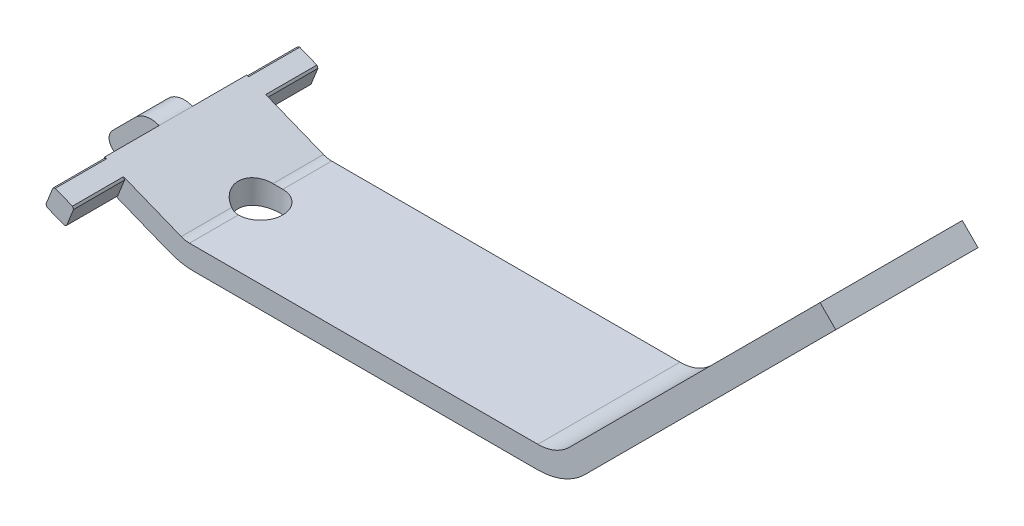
ISO-10303-21;
HEADER;
FILE_DESCRIPTION(('STEP AP214'),'2;1');
FILE_NAME('part.step','',(''),(''),'','','');
FILE_SCHEMA(('AUTOMOTIVE_DESIGN { 1 0 10303 214 1 1 1 1 }'));
ENDSEC;
DATA;
#1=APPLICATION_CONTEXT('core data for automotive mechanical design processes');
#2=APPLICATION_PROTOCOL_DEFINITION('international standard','automotive_design',2000,#1);
#3=PRODUCT_CONTEXT('',#1,'mechanical');
#4=PRODUCT('Part','Part','',(#3));
#5=PRODUCT_RELATED_PRODUCT_CATEGORY('part','',(#4));
#6=PRODUCT_DEFINITION_FORMATION('','',#4);
#7=PRODUCT_DEFINITION_CONTEXT('part definition',#1,'design');
#8=PRODUCT_DEFINITION('design','',#6,#7);
#9=PRODUCT_DEFINITION_SHAPE('','',#8);
#10=(LENGTH_UNIT() NAMED_UNIT(*) SI_UNIT(.MILLI.,.METRE.));
#11=(NAMED_UNIT(*) PLANE_ANGLE_UNIT() SI_UNIT($,.RADIAN.));
#12=(NAMED_UNIT(*) SI_UNIT($,.STERADIAN.) SOLID_ANGLE_UNIT());
#13=UNCERTAINTY_MEASURE_WITH_UNIT(LENGTH_MEASURE(1.E-05),#10,'distance_accuracy_value','');
#14=(GEOMETRIC_REPRESENTATION_CONTEXT(3) GLOBAL_UNCERTAINTY_ASSIGNED_CONTEXT((#13)) GLOBAL_UNIT_ASSIGNED_CONTEXT((#10,
#11,#12)) REPRESENTATION_CONTEXT('',''));
#15=CARTESIAN_POINT('',(0.,0.,0.));
#16=DIRECTION('',(0.,0.,1.));
#17=DIRECTION('',(1.,0.,0.));
#18=AXIS2_PLACEMENT_3D('',#15,#16,#17);
#19=CARTESIAN_POINT('',(3.73112428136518,1.2,3.2));
#20=DIRECTION('',(0.,0.,-1.));
#21=DIRECTION('',(-1.,0.,0.));
#22=AXIS2_PLACEMENT_3D('',#19,#20,#21);
#23=CYLINDRICAL_SURFACE('',#22,3.);
#24=CARTESIAN_POINT('',(2.61683856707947,-1.58538459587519,-0.387945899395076));
#25=CARTESIAN_POINT('',(2.639047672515,-1.59426285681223,-0.440770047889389));
#26=CARTESIAN_POINT('',(2.66571598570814,-1.60463297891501,-0.491380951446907));
#27=CARTESIAN_POINT('',(2.72699278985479,-1.62715226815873,-0.587054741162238));
#28=CARTESIAN_POINT('',(2.76159483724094,-1.63929998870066,-0.632122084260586));
#29=CARTESIAN_POINT('',(2.83776356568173,-1.66417616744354,-0.715636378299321));
#30=CARTESIAN_POINT('',(2.87932357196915,-1.67690406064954,-0.754089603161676));
#31=CARTESIAN_POINT('',(2.96843372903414,-1.70179977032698,-0.823522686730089));
#32=CARTESIAN_POINT('',(3.01598406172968,-1.7139675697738,-0.854502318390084));
#33=CARTESIAN_POINT('',(3.1167874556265,-1.73688632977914,-0.908550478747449));
#34=CARTESIAN_POINT('',(3.17012227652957,-1.74761033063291,-0.931478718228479));
#35=CARTESIAN_POINT('',(3.28035079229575,-1.76646697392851,-0.967840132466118));
#36=CARTESIAN_POINT('',(3.33724266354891,-1.7746009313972,-0.981278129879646));
#37=CARTESIAN_POINT('',(3.45048145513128,-1.78736378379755,-0.997686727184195));
#38=CARTESIAN_POINT('',(3.50675199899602,-1.79212481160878,-1.00107083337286));
#39=CARTESIAN_POINT('',(3.59114023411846,-1.79686651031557,-0.999014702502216));
#40=CARTESIAN_POINT('',(3.6193198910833,-1.79804704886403,-0.997130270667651));
#41=CARTESIAN_POINT('',(3.67544696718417,-1.79961498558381,-0.990983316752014));
#42=CARTESIAN_POINT('',(3.7033943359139,-1.80000221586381,-0.986720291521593));
#43=CARTESIAN_POINT('',(3.73112428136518,-1.8,-0.981276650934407));
#44=B_SPLINE_CURVE_WITH_KNOTS('',3,(#24,#25,#26,#27,#28,#29,#30,#31,#32,#33,#34,#35,#36,#37,#38,
#39,#40,#41,#42,#43),.UNSPECIFIED.,.F.,.F.,(4,2,2,2,2,2,2,2,2,4),(0.,0.173622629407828,
0.347104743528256,0.520421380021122,0.693743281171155,0.869950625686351,1.0460683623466,
1.2148347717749,1.29953835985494,1.38425987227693),.UNSPECIFIED.);
#45=CARTESIAN_POINT('',(2.61683856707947,-1.58538459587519,-0.387945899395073));
#46=VERTEX_POINT('',#45);
#47=CARTESIAN_POINT('',(3.73112428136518,-1.8,-0.981276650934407));
#48=VERTEX_POINT('',#47);
#49=EDGE_CURVE('E270',#46,#48,#44,.T.);
#50=ORIENTED_EDGE('',*,*,#49,.F.);
#51=DIRECTION('',(0.,0.,-1.));
#52=VECTOR('',#51,1.);
#53=CARTESIAN_POINT('',(2.61683856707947,-1.58538459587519,3.2));
#54=LINE('',#53,#52);
#55=CARTESIAN_POINT('',(2.61683856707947,-1.58538459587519,-3.2));
#56=VERTEX_POINT('',#55);
#57=EDGE_CURVE('E301',#56,#46,#54,.F.);
#58=ORIENTED_EDGE('',*,*,#57,.F.);
#59=CARTESIAN_POINT('',(3.73112428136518,1.2,-3.2));
#60=DIRECTION('',(0.,0.,1.));
#61=DIRECTION('',(1.,0.,0.));
#62=AXIS2_PLACEMENT_3D('',#59,#60,#61);
#63=CIRCLE('',#62,3.);
#64=CARTESIAN_POINT('',(3.73112428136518,-1.8,-3.2));
#65=VERTEX_POINT('',#64);
#66=EDGE_CURVE('E289',#65,#56,#63,.F.);
#67=ORIENTED_EDGE('',*,*,#66,.F.);
#68=DIRECTION('',(0.,0.,-1.));
#69=VECTOR('',#68,1.);
#70=CARTESIAN_POINT('',(3.73112428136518,-1.8,3.2));
#71=LINE('',#70,#69);
#72=EDGE_CURVE('E283',#48,#65,#71,.T.);
#73=ORIENTED_EDGE('',*,*,#72,.F.);
#74=EDGE_LOOP('',(#50,#58,#67,#73));
#75=FACE_BOUND('',#74,.T.);
#76=ADVANCED_FACE('F33',(#75),#23,.T.);
#77=CARTESIAN_POINT('',(3.53852071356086,0.2,3.2));
#78=DIRECTION('',(0.,0.,1.));
#79=DIRECTION('',(1.,0.,0.));
#80=AXIS2_PLACEMENT_3D('',#77,#78,#79);
#81=CYLINDRICAL_SURFACE('',#80,1.);
#82=DIRECTION('',(0.,0.,-1.));
#83=VECTOR('',#82,1.);
#84=CARTESIAN_POINT('',(3.53852071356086,-0.8,3.2));
#85=LINE('',#84,#83);
#86=CARTESIAN_POINT('',(3.53852071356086,-0.8,1.));
#87=VERTEX_POINT('',#86);
#88=CARTESIAN_POINT('',(3.53852071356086,-0.8,3.2));
#89=VERTEX_POINT('',#88);
#90=EDGE_CURVE('E309',#87,#89,#85,.F.);
#91=ORIENTED_EDGE('',*,*,#90,.F.);
#92=CARTESIAN_POINT('',(3.53852071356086,0.2,0.));
#93=DIRECTION('',(0.,0.707106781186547,0.707106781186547));
#94=DIRECTION('',(0.,-0.707106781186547,0.707106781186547));
#95=AXIS2_PLACEMENT_3D('',#92,#93,#94);
#96=ELLIPSE('',#95,1.41421356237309,1.);
#97=CARTESIAN_POINT('',(3.16709214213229,-0.728461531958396,0.928461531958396));
#98=VERTEX_POINT('',#97);
#99=EDGE_CURVE('E12',#87,#98,#96,.F.);
#100=ORIENTED_EDGE('',*,*,#99,.T.);
#101=DIRECTION('',(0.,0.,-1.));
#102=VECTOR('',#101,1.);
#103=CARTESIAN_POINT('',(3.16709214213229,-0.728461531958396,-3.2));
#104=LINE('',#103,#102);
#105=CARTESIAN_POINT('',(3.16709214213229,-0.728461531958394,3.2));
#106=VERTEX_POINT('',#105);
#107=EDGE_CURVE('E306',#106,#98,#104,.T.);
#108=ORIENTED_EDGE('',*,*,#107,.F.);
#109=CARTESIAN_POINT('',(3.53852071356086,0.2,3.2));
#110=DIRECTION('',(0.,0.,1.));
#111=DIRECTION('',(1.,0.,0.));
#112=AXIS2_PLACEMENT_3D('',#109,#110,#111);
#113=CIRCLE('',#112,1.);
#114=EDGE_CURVE('E315',#89,#106,#113,.F.);
#115=ORIENTED_EDGE('',*,*,#114,.F.);
#116=EDGE_LOOP('',(#91,#100,#108,#115));
#117=FACE_BOUND('',#116,.T.);
#118=ADVANCED_FACE('F598',(#117),#81,.F.);
#119=CARTESIAN_POINT('',(-0.278516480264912,0.649945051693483,3.2));
#120=DIRECTION('',(0.928461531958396,-0.371428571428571,0.));
#121=DIRECTION('',(0.371428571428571,0.928461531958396,0.));
#122=AXIS2_PLACEMENT_3D('',#119,#120,#121);
#123=PLANE('',#122);
#124=DIRECTION('',(0.371428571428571,0.928461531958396,0.));
#125=VECTOR('',#124,1.);
#126=CARTESIAN_POINT('',(-0.278516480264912,0.649945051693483,0.75));
#127=LINE('',#126,#125);
#128=CARTESIAN_POINT('',(-0.649945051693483,-0.278516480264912,0.75));
#129=VERTEX_POINT('',#128);
#130=CARTESIAN_POINT('',(-0.278516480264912,0.649945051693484,0.75));
#131=VERTEX_POINT('',#130);
#132=EDGE_CURVE('E391',#129,#131,#127,.T.);
#133=ORIENTED_EDGE('',*,*,#132,.F.);
#134=DIRECTION('',(0.,0.,-1.));
#135=VECTOR('',#134,1.);
#136=CARTESIAN_POINT('',(-0.649945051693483,-0.278516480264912,3.2));
#137=LINE('',#136,#135);
#138=CARTESIAN_POINT('',(-0.649945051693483,-0.278516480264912,3.2));
#139=VERTEX_POINT('',#138);
#140=EDGE_CURVE('E354',#139,#129,#137,.T.);
#141=ORIENTED_EDGE('',*,*,#140,.F.);
#142=DIRECTION('',(-0.371428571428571,-0.928461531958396,0.));
#143=VECTOR('',#142,1.);
#144=CARTESIAN_POINT('',(-0.278516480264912,0.649945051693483,3.2));
#145=LINE('',#144,#143);
#146=CARTESIAN_POINT('',(-0.618496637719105,-0.199904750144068,3.2));
#147=VERTEX_POINT('',#146);
#148=EDGE_CURVE('E507',#147,#139,#145,.T.);
#149=ORIENTED_EDGE('',*,*,#148,.F.);
#150=DIRECTION('',(0.,0.,1.));
#151=VECTOR('',#150,1.);
#152=CARTESIAN_POINT('',(-0.618496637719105,-0.199904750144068,-32.8346058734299));
#153=LINE('',#152,#151);
#154=CARTESIAN_POINT('',(-0.618496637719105,-0.199904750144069,5.5));
#155=VERTEX_POINT('',#154);
#156=EDGE_CURVE('E493',#155,#147,#153,.F.);
#157=ORIENTED_EDGE('',*,*,#156,.F.);
#158=DIRECTION('',(-0.371428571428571,-0.928461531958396,0.));
#159=VECTOR('',#158,1.);
#160=CARTESIAN_POINT('',(-0.278516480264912,0.649945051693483,5.5));
#161=LINE('',#160,#159);
#162=CARTESIAN_POINT('',(-0.309964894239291,0.57133332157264,5.5));
#163=VERTEX_POINT('',#162);
#164=EDGE_CURVE('E512',#163,#155,#161,.T.);
#165=ORIENTED_EDGE('',*,*,#164,.F.);
#166=DIRECTION('',(0.,0.,1.));
#167=VECTOR('',#166,1.);
#168=CARTESIAN_POINT('',(-0.309964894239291,0.57133332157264,-32.8346058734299));
#169=LINE('',#168,#167);
#170=CARTESIAN_POINT('',(-0.309964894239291,0.57133332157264,3.2));
#171=VERTEX_POINT('',#170);
#172=EDGE_CURVE('E495',#171,#163,#169,.T.);
#173=ORIENTED_EDGE('',*,*,#172,.F.);
#174=CARTESIAN_POINT('',(-0.278516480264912,0.649945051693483,3.2));
#175=VERTEX_POINT('',#174);
#176=EDGE_CURVE('E505',#175,#171,#145,.T.);
#177=ORIENTED_EDGE('',*,*,#176,.F.);
#178=DIRECTION('',(0.,0.,-1.));
#179=VECTOR('',#178,1.);
#180=CARTESIAN_POINT('',(-0.278516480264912,0.649945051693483,3.2));
#181=LINE('',#180,#179);
#182=EDGE_CURVE('E381',#175,#131,#181,.T.);
#183=ORIENTED_EDGE('',*,*,#182,.T.);
#184=EDGE_LOOP('',(#133,#141,#149,#157,#165,#173,#177,#183));
#185=FACE_BOUND('',#184,.T.);
#186=ADVANCED_FACE('F603',(#185),#123,.F.);
#187=CARTESIAN_POINT('',(0.185714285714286,0.464230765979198,3.2));
#188=DIRECTION('',(-0.371428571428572,-0.928461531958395,0.));
#189=DIRECTION('',(0.928461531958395,-0.371428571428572,0.));
#190=AXIS2_PLACEMENT_3D('',#187,#188,#189);
#191=PLANE('',#190);
#192=ORIENTED_EDGE('',*,*,#107,.T.);
#193=CARTESIAN_POINT('',(3.53852071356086,-0.877050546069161,0.));
#194=DIRECTION('',(-0.371428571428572,-0.928461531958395,0.));
#195=DIRECTION('',(-0.928461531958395,0.371428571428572,0.));
#196=AXIS2_PLACEMENT_3D('',#193,#194,#195);
#197=ELLIPSE('',#196,1.07705054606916,1.);
#198=CARTESIAN_POINT('',(3.16709214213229,-0.728461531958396,-0.928461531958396));
#199=VERTEX_POINT('',#198);
#200=EDGE_CURVE('E619',#98,#199,#197,.T.);
#201=ORIENTED_EDGE('',*,*,#200,.T.);
#202=CARTESIAN_POINT('',(3.16709214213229,-0.728461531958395,-3.2));
#203=VERTEX_POINT('',#202);
#204=EDGE_CURVE('E305',#199,#203,#104,.T.);
#205=ORIENTED_EDGE('',*,*,#204,.T.);
#206=DIRECTION('',(-0.928461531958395,0.371428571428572,0.));
#207=VECTOR('',#206,1.);
#208=CARTESIAN_POINT('',(0.185714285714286,0.464230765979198,-3.2));
#209=LINE('',#208,#207);
#210=CARTESIAN_POINT('',(0.57133332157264,0.309964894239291,-3.2));
#211=VERTEX_POINT('',#210);
#212=EDGE_CURVE('E333',#203,#211,#209,.T.);
#213=ORIENTED_EDGE('',*,*,#212,.T.);
#214=DIRECTION('',(0.,0.,-1.));
#215=VECTOR('',#214,1.);
#216=CARTESIAN_POINT('',(0.57133332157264,0.309964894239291,32.8346058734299));
#217=LINE('',#216,#215);
#218=CARTESIAN_POINT('',(0.57133332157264,0.309964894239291,-5.5));
#219=VERTEX_POINT('',#218);
#220=EDGE_CURVE('E471',#219,#211,#217,.F.);
#221=ORIENTED_EDGE('',*,*,#220,.F.);
#222=DIRECTION('',(-0.928461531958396,0.371428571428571,0.));
#223=VECTOR('',#222,1.);
#224=CARTESIAN_POINT('',(-0.278516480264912,0.649945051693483,-5.5));
#225=LINE('',#224,#223);
#226=CARTESIAN_POINT('',(-0.199904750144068,0.618496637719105,-5.5));
#227=VERTEX_POINT('',#226);
#228=EDGE_CURVE('E504',#219,#227,#225,.T.);
#229=ORIENTED_EDGE('',*,*,#228,.T.);
#230=DIRECTION('',(0.,0.,-1.));
#231=VECTOR('',#230,1.);
#232=CARTESIAN_POINT('',(-0.199904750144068,0.618496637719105,32.8346058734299));
#233=LINE('',#232,#231);
#234=CARTESIAN_POINT('',(-0.199904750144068,0.618496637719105,-3.2));
#235=VERTEX_POINT('',#234);
#236=EDGE_CURVE('E474',#235,#227,#233,.T.);
#237=ORIENTED_EDGE('',*,*,#236,.F.);
#238=DIRECTION('',(-0.928461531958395,0.371428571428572,0.));
#239=VECTOR('',#238,1.);
#240=CARTESIAN_POINT('',(0.185714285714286,0.464230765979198,-3.2));
#241=LINE('',#240,#239);
#242=CARTESIAN_POINT('',(-0.278516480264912,0.649945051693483,-3.2));
#243=VERTEX_POINT('',#242);
#244=EDGE_CURVE('E454',#235,#243,#241,.T.);
#245=ORIENTED_EDGE('',*,*,#244,.T.);
#246=CARTESIAN_POINT('',(-0.278516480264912,0.649945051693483,-0.75));
#247=VERTEX_POINT('',#246);
#248=EDGE_CURVE('E356',#247,#243,#181,.T.);
#249=ORIENTED_EDGE('',*,*,#248,.F.);
#250=DIRECTION('',(0.,0.,-1.));
#251=VECTOR('',#250,1.);
#252=CARTESIAN_POINT('',(-0.278516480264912,0.649945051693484,0.75));
#253=LINE('',#252,#251);
#254=EDGE_CURVE('E398',#131,#247,#253,.T.);
#255=ORIENTED_EDGE('',*,*,#254,.F.);
#256=ORIENTED_EDGE('',*,*,#182,.F.);
#257=DIRECTION('',(-0.928461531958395,0.371428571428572,0.));
#258=VECTOR('',#257,1.);
#259=CARTESIAN_POINT('',(0.185714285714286,0.464230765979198,3.2));
#260=LINE('',#259,#258);
#261=CARTESIAN_POINT('',(-0.199904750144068,0.618496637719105,3.2));
#262=VERTEX_POINT('',#261);
#263=EDGE_CURVE('E502',#262,#175,#260,.T.);
#264=ORIENTED_EDGE('',*,*,#263,.F.);
#265=DIRECTION('',(0.,0.,1.));
#266=VECTOR('',#265,1.);
#267=CARTESIAN_POINT('',(-0.199904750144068,0.618496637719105,-32.8346058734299));
#268=LINE('',#267,#266);
#269=CARTESIAN_POINT('',(-0.199904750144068,0.618496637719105,5.5));
#270=VERTEX_POINT('',#269);
#271=EDGE_CURVE('E497',#270,#262,#268,.F.);
#272=ORIENTED_EDGE('',*,*,#271,.F.);
#273=DIRECTION('',(-0.928461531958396,0.371428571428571,0.));
#274=VECTOR('',#273,1.);
#275=CARTESIAN_POINT('',(-0.278516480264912,0.649945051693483,5.5));
#276=LINE('',#275,#274);
#277=CARTESIAN_POINT('',(0.57133332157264,0.309964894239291,5.5));
#278=VERTEX_POINT('',#277);
#279=EDGE_CURVE('E509',#278,#270,#276,.T.);
#280=ORIENTED_EDGE('',*,*,#279,.F.);
#281=DIRECTION('',(0.,0.,1.));
#282=VECTOR('',#281,1.);
#283=CARTESIAN_POINT('',(0.57133332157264,0.309964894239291,-32.8346058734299));
#284=LINE('',#283,#282);
#285=CARTESIAN_POINT('',(0.57133332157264,0.309964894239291,3.2));
#286=VERTEX_POINT('',#285);
#287=EDGE_CURVE('E499',#286,#278,#284,.T.);
#288=ORIENTED_EDGE('',*,*,#287,.F.);
#289=DIRECTION('',(-0.928461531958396,0.371428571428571,0.));
#290=VECTOR('',#289,1.);
#291=CARTESIAN_POINT('',(0.185714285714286,0.464230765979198,3.2));
#292=LINE('',#291,#290);
#293=EDGE_CURVE('E550',#106,#286,#292,.T.);
#294=ORIENTED_EDGE('',*,*,#293,.F.);
#295=EDGE_LOOP('',(#192,#201,#205,#213,#221,#229,#237,#245,#249,#255,#256,#264,#272,#280,#288,#294));
#296=FACE_BOUND('',#295,.T.);
#297=ADVANCED_FACE('F718',(#296),#191,.F.);
#298=CARTESIAN_POINT('',(-0.649945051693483,-0.278516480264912,-0.75));
#299=VERTEX_POINT('',#298);
#300=CARTESIAN_POINT('',(-0.649945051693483,-0.278516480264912,-3.2));
#301=VERTEX_POINT('',#300);
#302=EDGE_CURVE('E351',#299,#301,#137,.T.);
#303=ORIENTED_EDGE('',*,*,#302,.F.);
#304=DIRECTION('',(0.371428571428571,0.928461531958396,0.));
#305=VECTOR('',#304,1.);
#306=CARTESIAN_POINT('',(-0.278516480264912,0.649945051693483,-0.75));
#307=LINE('',#306,#305);
#308=EDGE_CURVE('E278',#299,#247,#307,.T.);
#309=ORIENTED_EDGE('',*,*,#308,.T.);
#310=ORIENTED_EDGE('',*,*,#248,.T.);
#311=DIRECTION('',(-0.371428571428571,-0.928461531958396,0.));
#312=VECTOR('',#311,1.);
#313=CARTESIAN_POINT('',(-0.278516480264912,0.649945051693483,-3.2));
#314=LINE('',#313,#312);
#315=CARTESIAN_POINT('',(-0.309964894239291,0.57133332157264,-3.2));
#316=VERTEX_POINT('',#315);
#317=EDGE_CURVE('E458',#243,#316,#314,.T.);
#318=ORIENTED_EDGE('',*,*,#317,.T.);
#319=DIRECTION('',(0.,0.,-1.));
#320=VECTOR('',#319,1.);
#321=CARTESIAN_POINT('',(-0.309964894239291,0.57133332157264,32.8346058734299));
#322=LINE('',#321,#320);
#323=CARTESIAN_POINT('',(-0.309964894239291,0.57133332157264,-5.5));
#324=VERTEX_POINT('',#323);
#325=EDGE_CURVE('E467',#324,#316,#322,.F.);
#326=ORIENTED_EDGE('',*,*,#325,.F.);
#327=DIRECTION('',(-0.371428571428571,-0.928461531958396,0.));
#328=VECTOR('',#327,1.);
#329=CARTESIAN_POINT('',(-0.278516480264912,0.649945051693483,-5.5));
#330=LINE('',#329,#328);
#331=CARTESIAN_POINT('',(-0.618496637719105,-0.199904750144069,-5.5));
#332=VERTEX_POINT('',#331);
#333=EDGE_CURVE('E525',#324,#332,#330,.T.);
#334=ORIENTED_EDGE('',*,*,#333,.T.);
#335=DIRECTION('',(0.,0.,-1.));
#336=VECTOR('',#335,1.);
#337=CARTESIAN_POINT('',(-0.618496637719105,-0.199904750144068,32.8346058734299));
#338=LINE('',#337,#336);
#339=CARTESIAN_POINT('',(-0.618496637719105,-0.199904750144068,-3.2));
#340=VERTEX_POINT('',#339);
#341=EDGE_CURVE('E469',#340,#332,#338,.T.);
#342=ORIENTED_EDGE('',*,*,#341,.F.);
#343=EDGE_CURVE('E461',#340,#301,#314,.T.);
#344=ORIENTED_EDGE('',*,*,#343,.T.);
#345=EDGE_LOOP('',(#303,#309,#310,#318,#326,#334,#342,#344));
#346=FACE_BOUND('',#345,.T.);
#347=ADVANCED_FACE('F714',(#346),#123,.F.);
#348=CARTESIAN_POINT('',(-0.185714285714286,-0.464230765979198,3.2));
#349=DIRECTION('',(0.371428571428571,0.928461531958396,0.));
#350=DIRECTION('',(-0.928461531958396,0.371428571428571,0.));
#351=AXIS2_PLACEMENT_3D('',#348,#349,#350);
#352=PLANE('',#351);
#353=ORIENTED_EDGE('',*,*,#57,.T.);
#354=CARTESIAN_POINT('',(3.53852071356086,-1.95410109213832,0.));
#355=DIRECTION('',(0.371428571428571,0.928461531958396,0.));
#356=DIRECTION('',(-0.928461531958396,0.371428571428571,0.));
#357=AXIS2_PLACEMENT_3D('',#354,#355,#356);
#358=ELLIPSE('',#357,1.07705054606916,1.);
#359=CARTESIAN_POINT('',(2.61683856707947,-1.58538459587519,0.387945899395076));
#360=VERTEX_POINT('',#359);
#361=EDGE_CURVE('E273',#46,#360,#358,.T.);
#362=ORIENTED_EDGE('',*,*,#361,.T.);
#363=CARTESIAN_POINT('',(2.61683856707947,-1.58538459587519,3.2));
#364=VERTEX_POINT('',#363);
#365=EDGE_CURVE('E300',#360,#364,#54,.F.);
#366=ORIENTED_EDGE('',*,*,#365,.T.);
#367=DIRECTION('',(0.928461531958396,-0.371428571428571,0.));
#368=VECTOR('',#367,1.);
#369=CARTESIAN_POINT('',(-0.649945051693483,-0.278516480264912,3.2));
#370=LINE('',#369,#368);
#371=CARTESIAN_POINT('',(0.199904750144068,-0.618496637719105,3.2));
#372=VERTEX_POINT('',#371);
#373=EDGE_CURVE('E552',#372,#364,#370,.T.);
#374=ORIENTED_EDGE('',*,*,#373,.F.);
#375=DIRECTION('',(0.,0.,1.));
#376=VECTOR('',#375,1.);
#377=CARTESIAN_POINT('',(0.199904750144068,-0.618496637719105,-32.8346058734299));
#378=LINE('',#377,#376);
#379=CARTESIAN_POINT('',(0.199904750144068,-0.618496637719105,5.5));
#380=VERTEX_POINT('',#379);
#381=EDGE_CURVE('E488',#380,#372,#378,.F.);
#382=ORIENTED_EDGE('',*,*,#381,.F.);
#383=DIRECTION('',(0.928461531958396,-0.371428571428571,0.));
#384=VECTOR('',#383,1.);
#385=CARTESIAN_POINT('',(-0.649945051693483,-0.278516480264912,5.5));
#386=LINE('',#385,#384);
#387=CARTESIAN_POINT('',(-0.571333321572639,-0.309964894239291,5.5));
#388=VERTEX_POINT('',#387);
#389=EDGE_CURVE('E516',#388,#380,#386,.T.);
#390=ORIENTED_EDGE('',*,*,#389,.F.);
#391=DIRECTION('',(0.,0.,1.));
#392=VECTOR('',#391,1.);
#393=CARTESIAN_POINT('',(-0.57133332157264,-0.309964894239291,-32.8346058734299));
#394=LINE('',#393,#392);
#395=CARTESIAN_POINT('',(-0.57133332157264,-0.309964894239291,3.2));
#396=VERTEX_POINT('',#395);
#397=EDGE_CURVE('E491',#396,#388,#394,.T.);
#398=ORIENTED_EDGE('',*,*,#397,.F.);
#399=DIRECTION('',(0.928461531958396,-0.371428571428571,0.));
#400=VECTOR('',#399,1.);
#401=CARTESIAN_POINT('',(-0.185714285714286,-0.464230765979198,3.2));
#402=LINE('',#401,#400);
#403=EDGE_CURVE('E501',#139,#396,#402,.T.);
#404=ORIENTED_EDGE('',*,*,#403,.F.);
#405=ORIENTED_EDGE('',*,*,#140,.T.);
#406=DIRECTION('',(0.,0.,-1.));
#407=VECTOR('',#406,1.);
#408=CARTESIAN_POINT('',(-0.649945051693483,-0.278516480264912,0.75));
#409=LINE('',#408,#407);
#410=EDGE_CURVE('E439',#129,#299,#409,.T.);
#411=ORIENTED_EDGE('',*,*,#410,.T.);
#412=ORIENTED_EDGE('',*,*,#302,.T.);
#413=DIRECTION('',(0.928461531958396,-0.371428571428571,0.));
#414=VECTOR('',#413,1.);
#415=CARTESIAN_POINT('',(-0.185714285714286,-0.464230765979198,-3.2));
#416=LINE('',#415,#414);
#417=CARTESIAN_POINT('',(-0.57133332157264,-0.309964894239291,-3.2));
#418=VERTEX_POINT('',#417);
#419=EDGE_CURVE('E452',#301,#418,#416,.T.);
#420=ORIENTED_EDGE('',*,*,#419,.T.);
#421=DIRECTION('',(0.,0.,-1.));
#422=VECTOR('',#421,1.);
#423=CARTESIAN_POINT('',(-0.57133332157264,-0.309964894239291,32.8346058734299));
#424=LINE('',#423,#422);
#425=CARTESIAN_POINT('',(-0.571333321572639,-0.309964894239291,-5.5));
#426=VERTEX_POINT('',#425);
#427=EDGE_CURVE('E457',#426,#418,#424,.F.);
#428=ORIENTED_EDGE('',*,*,#427,.F.);
#429=DIRECTION('',(0.928461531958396,-0.371428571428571,0.));
#430=VECTOR('',#429,1.);
#431=CARTESIAN_POINT('',(-0.649945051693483,-0.278516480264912,-5.5));
#432=LINE('',#431,#430);
#433=CARTESIAN_POINT('',(0.199904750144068,-0.618496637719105,-5.5));
#434=VERTEX_POINT('',#433);
#435=EDGE_CURVE('E528',#426,#434,#432,.T.);
#436=ORIENTED_EDGE('',*,*,#435,.T.);
#437=DIRECTION('',(0.,0.,-1.));
#438=VECTOR('',#437,1.);
#439=CARTESIAN_POINT('',(0.199904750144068,-0.618496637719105,32.8346058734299));
#440=LINE('',#439,#438);
#441=CARTESIAN_POINT('',(0.199904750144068,-0.618496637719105,-3.2));
#442=VERTEX_POINT('',#441);
#443=EDGE_CURVE('E465',#442,#434,#440,.T.);
#444=ORIENTED_EDGE('',*,*,#443,.F.);
#445=DIRECTION('',(0.928461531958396,-0.371428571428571,0.));
#446=VECTOR('',#445,1.);
#447=CARTESIAN_POINT('',(-0.185714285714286,-0.464230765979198,-3.2));
#448=LINE('',#447,#446);
#449=EDGE_CURVE('E336',#442,#56,#448,.T.);
#450=ORIENTED_EDGE('',*,*,#449,.T.);
#451=EDGE_LOOP('',(#353,#362,#366,#374,#382,#390,#398,#404,#405,#411,#412,#420,#428,#436,#444,#450));
#452=FACE_BOUND('',#451,.T.);
#453=ADVANCED_FACE('F664',(#452),#352,.F.);
#454=CARTESIAN_POINT('',(0.649945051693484,0.278516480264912,-5.5));
#455=DIRECTION('',(0.,0.,-1.));
#456=DIRECTION('',(-1.,0.,0.));
#457=AXIS2_PLACEMENT_3D('',#454,#455,#456);
#458=PLANE('',#457);
#459=ORIENTED_EDGE('',*,*,#333,.F.);
#460=CARTESIAN_POINT('',(0.,0.,-5.5));
#461=DIRECTION('',(0.,0.,-1.));
#462=DIRECTION('',(-1.,0.,0.));
#463=AXIS2_PLACEMENT_3D('',#460,#461,#462);
#464=CIRCLE('',#463,0.65);
#465=EDGE_CURVE('E443',#324,#227,#464,.T.);
#466=ORIENTED_EDGE('',*,*,#465,.T.);
#467=ORIENTED_EDGE('',*,*,#228,.F.);
#468=CARTESIAN_POINT('',(0.618496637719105,0.199904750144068,-5.5));
#469=VERTEX_POINT('',#468);
#470=EDGE_CURVE('E447',#219,#469,#464,.T.);
#471=ORIENTED_EDGE('',*,*,#470,.T.);
#472=DIRECTION('',(0.371428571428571,0.928461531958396,0.));
#473=VECTOR('',#472,1.);
#474=CARTESIAN_POINT('',(0.649945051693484,0.278516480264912,-5.5));
#475=LINE('',#474,#473);
#476=CARTESIAN_POINT('',(0.309964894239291,-0.571333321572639,-5.5));
#477=VERTEX_POINT('',#476);
#478=EDGE_CURVE('E513',#477,#469,#475,.T.);
#479=ORIENTED_EDGE('',*,*,#478,.F.);
#480=EDGE_CURVE('E738',#477,#434,#464,.T.);
#481=ORIENTED_EDGE('',*,*,#480,.T.);
#482=ORIENTED_EDGE('',*,*,#435,.F.);
#483=EDGE_CURVE('E448',#426,#332,#464,.T.);
#484=ORIENTED_EDGE('',*,*,#483,.T.);
#485=EDGE_LOOP('',(#459,#466,#467,#471,#479,#481,#482,#484));
#486=FACE_BOUND('',#485,.T.);
#487=ADVANCED_FACE('F660',(#486),#458,.T.);
#488=CARTESIAN_POINT('',(0.649945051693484,0.278516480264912,5.5));
#489=DIRECTION('',(-0.928461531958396,0.371428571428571,0.));
#490=DIRECTION('',(-0.371428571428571,-0.928461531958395,0.));
#491=AXIS2_PLACEMENT_3D('',#488,#489,#490);
#492=PLANE('',#491);
#493=DIRECTION('',(0.,0.,-1.));
#494=VECTOR('',#493,1.);
#495=CARTESIAN_POINT('',(0.618496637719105,0.199904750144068,32.8346058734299));
#496=LINE('',#495,#494);
#497=CARTESIAN_POINT('',(0.618496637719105,0.199904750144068,-3.2));
#498=VERTEX_POINT('',#497);
#499=EDGE_CURVE('E291',#498,#469,#496,.T.);
#500=ORIENTED_EDGE('',*,*,#499,.F.);
#501=DIRECTION('',(-0.371428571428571,-0.928461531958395,0.));
#502=VECTOR('',#501,1.);
#503=CARTESIAN_POINT('',(3.52881832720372,7.47484788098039,-3.2));
#504=LINE('',#503,#502);
#505=CARTESIAN_POINT('',(0.309964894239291,-0.571333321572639,-3.2));
#506=VERTEX_POINT('',#505);
#507=EDGE_CURVE('E364',#498,#506,#504,.T.);
#508=ORIENTED_EDGE('',*,*,#507,.T.);
#509=DIRECTION('',(0.,0.,-1.));
#510=VECTOR('',#509,1.);
#511=CARTESIAN_POINT('',(0.309964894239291,-0.571333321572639,32.8346058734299));
#512=LINE('',#511,#510);
#513=EDGE_CURVE('E293',#477,#506,#512,.F.);
#514=ORIENTED_EDGE('',*,*,#513,.F.);
#515=ORIENTED_EDGE('',*,*,#478,.T.);
#516=EDGE_LOOP('',(#500,#508,#514,#515));
#517=FACE_BOUND('',#516,.T.);
#518=ADVANCED_FACE('F663',(#517),#492,.F.);
#519=DIRECTION('',(0.,0.,1.));
#520=VECTOR('',#519,1.);
#521=CARTESIAN_POINT('',(0.309964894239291,-0.571333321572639,-32.8346058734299));
#522=LINE('',#521,#520);
#523=CARTESIAN_POINT('',(0.309964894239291,-0.571333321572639,3.2));
#524=VERTEX_POINT('',#523);
#525=CARTESIAN_POINT('',(0.309964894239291,-0.571333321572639,5.5));
#526=VERTEX_POINT('',#525);
#527=EDGE_CURVE('E486',#524,#526,#522,.T.);
#528=ORIENTED_EDGE('',*,*,#527,.F.);
#529=DIRECTION('',(-0.371428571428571,-0.928461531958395,0.));
#530=VECTOR('',#529,1.);
#531=CARTESIAN_POINT('',(3.52881832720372,7.47484788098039,3.2));
#532=LINE('',#531,#530);
#533=CARTESIAN_POINT('',(0.618496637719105,0.199904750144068,3.2));
#534=VERTEX_POINT('',#533);
#535=EDGE_CURVE('E522',#534,#524,#532,.T.);
#536=ORIENTED_EDGE('',*,*,#535,.F.);
#537=DIRECTION('',(0.,0.,1.));
#538=VECTOR('',#537,1.);
#539=CARTESIAN_POINT('',(0.618496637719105,0.199904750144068,-32.8346058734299));
#540=LINE('',#539,#538);
#541=CARTESIAN_POINT('',(0.618496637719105,0.199904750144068,5.5));
#542=VERTEX_POINT('',#541);
#543=EDGE_CURVE('E483',#542,#534,#540,.F.);
#544=ORIENTED_EDGE('',*,*,#543,.F.);
#545=DIRECTION('',(0.371428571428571,0.928461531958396,0.));
#546=VECTOR('',#545,1.);
#547=CARTESIAN_POINT('',(0.649945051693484,0.278516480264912,5.5));
#548=LINE('',#547,#546);
#549=EDGE_CURVE('E519',#526,#542,#548,.T.);
#550=ORIENTED_EDGE('',*,*,#549,.F.);
#551=EDGE_LOOP('',(#528,#536,#544,#550));
#552=FACE_BOUND('',#551,.T.);
#553=ADVANCED_FACE('F658',(#552),#492,.F.);
#554=CARTESIAN_POINT('',(0.649945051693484,0.278516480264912,5.5));
#555=DIRECTION('',(0.,0.,-1.));
#556=DIRECTION('',(-1.,0.,0.));
#557=AXIS2_PLACEMENT_3D('',#554,#555,#556);
#558=PLANE('',#557);
#559=CARTESIAN_POINT('',(0.,0.,5.5));
#560=DIRECTION('',(0.,0.,-1.));
#561=DIRECTION('',(-1.,0.,0.));
#562=AXIS2_PLACEMENT_3D('',#559,#560,#561);
#563=CIRCLE('',#562,0.65);
#564=EDGE_CURVE('E360',#163,#270,#563,.T.);
#565=ORIENTED_EDGE('',*,*,#564,.F.);
#566=ORIENTED_EDGE('',*,*,#164,.T.);
#567=EDGE_CURVE('E361',#388,#155,#563,.T.);
#568=ORIENTED_EDGE('',*,*,#567,.F.);
#569=ORIENTED_EDGE('',*,*,#389,.T.);
#570=EDGE_CURVE('E363',#526,#380,#563,.T.);
#571=ORIENTED_EDGE('',*,*,#570,.F.);
#572=ORIENTED_EDGE('',*,*,#549,.T.);
#573=CARTESIAN_POINT('',(0.,0.,5.5));
#574=DIRECTION('',(0.,0.,1.));
#575=DIRECTION('',(1.,0.,0.));
#576=AXIS2_PLACEMENT_3D('',#573,#574,#575);
#577=CIRCLE('',#576,0.65);
#578=EDGE_CURVE('E476',#542,#278,#577,.T.);
#579=ORIENTED_EDGE('',*,*,#578,.T.);
#580=ORIENTED_EDGE('',*,*,#279,.T.);
#581=EDGE_LOOP('',(#565,#566,#568,#569,#571,#572,#579,#580));
#582=FACE_BOUND('',#581,.T.);
#583=ADVANCED_FACE('F584',(#582),#558,.F.);
#584=CARTESIAN_POINT('',(19.2140814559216,1.2,3.2));
#585=DIRECTION('',(0.,0.,1.));
#586=DIRECTION('',(1.,0.,0.));
#587=AXIS2_PLACEMENT_3D('',#584,#585,#586);
#588=PLANE('',#587);
#589=ORIENTED_EDGE('',*,*,#373,.T.);
#590=CARTESIAN_POINT('',(3.73112428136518,1.2,3.2));
#591=DIRECTION('',(0.,0.,1.));
#592=DIRECTION('',(1.,0.,0.));
#593=AXIS2_PLACEMENT_3D('',#590,#591,#592);
#594=CIRCLE('',#593,3.);
#595=CARTESIAN_POINT('',(3.73112428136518,-1.8,3.2));
#596=VERTEX_POINT('',#595);
#597=EDGE_CURVE('E303',#364,#596,#594,.T.);
#598=ORIENTED_EDGE('',*,*,#597,.T.);
#599=DIRECTION('',(1.,0.,0.));
#600=VECTOR('',#599,1.);
#601=CARTESIAN_POINT('',(3.15331357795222,-1.8,3.2));
#602=LINE('',#601,#600);
#603=CARTESIAN_POINT('',(19.2140814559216,-1.8,3.2));
#604=VERTEX_POINT('',#603);
#605=EDGE_CURVE('E344',#596,#604,#602,.T.);
#606=ORIENTED_EDGE('',*,*,#605,.T.);
#607=CARTESIAN_POINT('',(19.2140814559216,1.2,3.2));
#608=DIRECTION('',(0.,0.,1.));
#609=DIRECTION('',(1.,0.,0.));
#610=AXIS2_PLACEMENT_3D('',#607,#608,#609);
#611=CIRCLE('',#610,3.);
#612=CARTESIAN_POINT('',(21.3354017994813,-0.921320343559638,3.2));
#613=VERTEX_POINT('',#612);
#614=EDGE_CURVE('E537',#604,#613,#611,.T.);
#615=ORIENTED_EDGE('',*,*,#614,.T.);
#616=DIRECTION('',(0.707106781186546,0.707106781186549,0.));
#617=VECTOR('',#616,1.);
#618=CARTESIAN_POINT('',(21.3354017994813,-0.921320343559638,3.2));
#619=LINE('',#618,#617);
#620=CARTESIAN_POINT('',(32.6239840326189,10.3672618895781,3.2));
#621=VERTEX_POINT('',#620);
#622=EDGE_CURVE('E539',#613,#621,#619,.T.);
#623=ORIENTED_EDGE('',*,*,#622,.T.);
#624=DIRECTION('',(-0.707106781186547,0.707106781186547,0.));
#625=VECTOR('',#624,1.);
#626=CARTESIAN_POINT('',(31.9168772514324,11.0743686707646,3.2));
#627=LINE('',#626,#625);
#628=CARTESIAN_POINT('',(31.9168772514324,11.0743686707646,3.2));
#629=VERTEX_POINT('',#628);
#630=EDGE_CURVE('E541',#621,#629,#627,.T.);
#631=ORIENTED_EDGE('',*,*,#630,.T.);
#632=DIRECTION('',(-0.707106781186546,-0.707106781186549,0.));
#633=VECTOR('',#632,1.);
#634=CARTESIAN_POINT('',(20.6282950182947,-0.214213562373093,3.2));
#635=LINE('',#634,#633);
#636=CARTESIAN_POINT('',(20.6282950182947,-0.214213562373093,3.2));
#637=VERTEX_POINT('',#636);
#638=EDGE_CURVE('E543',#629,#637,#635,.T.);
#639=ORIENTED_EDGE('',*,*,#638,.T.);
#640=CARTESIAN_POINT('',(19.2140814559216,1.2,3.2));
#641=DIRECTION('',(0.,0.,-1.));
#642=DIRECTION('',(1.,0.,0.));
#643=AXIS2_PLACEMENT_3D('',#640,#641,#642);
#644=CIRCLE('',#643,2.);
#645=CARTESIAN_POINT('',(19.2140814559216,-0.8,3.2));
#646=VERTEX_POINT('',#645);
#647=EDGE_CURVE('E545',#637,#646,#644,.T.);
#648=ORIENTED_EDGE('',*,*,#647,.T.);
#649=DIRECTION('',(-1.,0.,0.));
#650=VECTOR('',#649,1.);
#651=CARTESIAN_POINT('',(3.34591714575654,-0.8,3.2));
#652=LINE('',#651,#650);
#653=EDGE_CURVE('E547',#646,#89,#652,.T.);
#654=ORIENTED_EDGE('',*,*,#653,.T.);
#655=ORIENTED_EDGE('',*,*,#114,.T.);
#656=ORIENTED_EDGE('',*,*,#293,.T.);
#657=CARTESIAN_POINT('',(0.,0.,3.2));
#658=DIRECTION('',(0.,0.,1.));
#659=DIRECTION('',(1.,0.,0.));
#660=AXIS2_PLACEMENT_3D('',#657,#658,#659);
#661=CIRCLE('',#660,0.65);
#662=EDGE_CURVE('E479',#286,#534,#661,.F.);
#663=ORIENTED_EDGE('',*,*,#662,.T.);
#664=ORIENTED_EDGE('',*,*,#535,.T.);
#665=EDGE_CURVE('E480',#524,#372,#661,.F.);
#666=ORIENTED_EDGE('',*,*,#665,.T.);
#667=EDGE_LOOP('',(#589,#598,#606,#615,#623,#631,#639,#648,#654,#655,#656,#663,#664,#666));
#668=FACE_BOUND('',#667,.T.);
#669=ADVANCED_FACE('F574',(#668),#588,.T.);
#670=CARTESIAN_POINT('',(19.2140814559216,1.2,-3.2));
#671=DIRECTION('',(0.,0.,1.));
#672=DIRECTION('',(1.,0.,0.));
#673=AXIS2_PLACEMENT_3D('',#670,#671,#672);
#674=PLANE('',#673);
#675=DIRECTION('',(1.,0.,0.));
#676=VECTOR('',#675,1.);
#677=CARTESIAN_POINT('',(3.15331357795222,-1.8,-3.2));
#678=LINE('',#677,#676);
#679=CARTESIAN_POINT('',(19.2140814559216,-1.8,-3.2));
#680=VERTEX_POINT('',#679);
#681=EDGE_CURVE('E535',#65,#680,#678,.T.);
#682=ORIENTED_EDGE('',*,*,#681,.F.);
#683=ORIENTED_EDGE('',*,*,#66,.T.);
#684=ORIENTED_EDGE('',*,*,#449,.F.);
#685=CARTESIAN_POINT('',(0.,0.,-3.2));
#686=DIRECTION('',(0.,0.,1.));
#687=DIRECTION('',(1.,0.,0.));
#688=AXIS2_PLACEMENT_3D('',#685,#686,#687);
#689=CIRCLE('',#688,0.65);
#690=EDGE_CURVE('E449',#506,#442,#689,.F.);
#691=ORIENTED_EDGE('',*,*,#690,.F.);
#692=ORIENTED_EDGE('',*,*,#507,.F.);
#693=EDGE_CURVE('E446',#211,#498,#689,.F.);
#694=ORIENTED_EDGE('',*,*,#693,.F.);
#695=ORIENTED_EDGE('',*,*,#212,.F.);
#696=CARTESIAN_POINT('',(3.53852071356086,0.2,-3.2));
#697=DIRECTION('',(0.,0.,1.));
#698=DIRECTION('',(1.,0.,0.));
#699=AXIS2_PLACEMENT_3D('',#696,#697,#698);
#700=CIRCLE('',#699,1.);
#701=CARTESIAN_POINT('',(3.53852071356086,-0.8,-3.2));
#702=VERTEX_POINT('',#701);
#703=EDGE_CURVE('E313',#203,#702,#700,.T.);
#704=ORIENTED_EDGE('',*,*,#703,.T.);
#705=DIRECTION('',(-1.,0.,0.));
#706=VECTOR('',#705,1.);
#707=CARTESIAN_POINT('',(3.34591714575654,-0.8,-3.2));
#708=LINE('',#707,#706);
#709=CARTESIAN_POINT('',(19.2140814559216,-0.8,-3.2));
#710=VERTEX_POINT('',#709);
#711=EDGE_CURVE('E327',#710,#702,#708,.T.);
#712=ORIENTED_EDGE('',*,*,#711,.F.);
#713=CARTESIAN_POINT('',(19.2140814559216,1.2,-3.2));
#714=DIRECTION('',(0.,0.,-1.));
#715=DIRECTION('',(1.,0.,0.));
#716=AXIS2_PLACEMENT_3D('',#713,#714,#715);
#717=CIRCLE('',#716,2.);
#718=CARTESIAN_POINT('',(20.6282950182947,-0.214213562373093,-3.2));
#719=VERTEX_POINT('',#718);
#720=EDGE_CURVE('E334',#719,#710,#717,.T.);
#721=ORIENTED_EDGE('',*,*,#720,.F.);
#722=DIRECTION('',(-0.707106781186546,-0.707106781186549,0.));
#723=VECTOR('',#722,1.);
#724=CARTESIAN_POINT('',(20.6282950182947,-0.214213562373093,-3.2));
#725=LINE('',#724,#723);
#726=CARTESIAN_POINT('',(31.9168772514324,11.0743686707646,-3.2));
#727=VERTEX_POINT('',#726);
#728=EDGE_CURVE('E338',#727,#719,#725,.T.);
#729=ORIENTED_EDGE('',*,*,#728,.F.);
#730=DIRECTION('',(-0.707106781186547,0.707106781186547,0.));
#731=VECTOR('',#730,1.);
#732=CARTESIAN_POINT('',(31.9168772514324,11.0743686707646,-3.2));
#733=LINE('',#732,#731);
#734=CARTESIAN_POINT('',(32.6239840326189,10.3672618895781,-3.2));
#735=VERTEX_POINT('',#734);
#736=EDGE_CURVE('E560',#735,#727,#733,.T.);
#737=ORIENTED_EDGE('',*,*,#736,.F.);
#738=DIRECTION('',(0.707106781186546,0.707106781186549,0.));
#739=VECTOR('',#738,1.);
#740=CARTESIAN_POINT('',(21.3354017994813,-0.921320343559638,-3.2));
#741=LINE('',#740,#739);
#742=CARTESIAN_POINT('',(21.3354017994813,-0.921320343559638,-3.2));
#743=VERTEX_POINT('',#742);
#744=EDGE_CURVE('E558',#743,#735,#741,.T.);
#745=ORIENTED_EDGE('',*,*,#744,.F.);
#746=CARTESIAN_POINT('',(19.2140814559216,1.2,-3.2));
#747=DIRECTION('',(0.,0.,1.));
#748=DIRECTION('',(1.,0.,0.));
#749=AXIS2_PLACEMENT_3D('',#746,#747,#748);
#750=CIRCLE('',#749,3.);
#751=EDGE_CURVE('E556',#680,#743,#750,.T.);
#752=ORIENTED_EDGE('',*,*,#751,.F.);
#753=EDGE_LOOP('',(#682,#683,#684,#691,#692,#694,#695,#704,#712,#721,#729,#737,#745,#752));
#754=FACE_BOUND('',#753,.T.);
#755=ADVANCED_FACE('F571',(#754),#674,.F.);
#756=CARTESIAN_POINT('',(3.15331357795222,-1.8,3.2));
#757=DIRECTION('',(0.,1.,0.));
#758=DIRECTION('',(0.,0.,1.));
#759=AXIS2_PLACEMENT_3D('',#756,#757,#758);
#760=PLANE('',#759);
#761=CARTESIAN_POINT('',(3.73112428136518,-1.8,0.981276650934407));
#762=VERTEX_POINT('',#761);
#763=EDGE_CURVE('E287',#596,#762,#71,.T.);
#764=ORIENTED_EDGE('',*,*,#763,.T.);
#765=CARTESIAN_POINT('',(3.53852071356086,-1.8,0.));
#766=DIRECTION('',(0.,1.,0.));
#767=DIRECTION('',(0.,0.,1.));
#768=AXIS2_PLACEMENT_3D('',#765,#766,#767);
#769=CIRCLE('',#768,1.);
#770=EDGE_CURVE('E48',#762,#48,#769,.T.);
#771=ORIENTED_EDGE('',*,*,#770,.T.);
#772=ORIENTED_EDGE('',*,*,#72,.T.);
#773=ORIENTED_EDGE('',*,*,#681,.T.);
#774=DIRECTION('',(0.,0.,-1.));
#775=VECTOR('',#774,1.);
#776=CARTESIAN_POINT('',(19.2140814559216,-1.8,3.2));
#777=LINE('',#776,#775);
#778=EDGE_CURVE('E367',#604,#680,#777,.T.);
#779=ORIENTED_EDGE('',*,*,#778,.F.);
#780=ORIENTED_EDGE('',*,*,#605,.F.);
#781=EDGE_LOOP('',(#764,#771,#772,#773,#779,#780));
#782=FACE_BOUND('',#781,.T.);
#783=ADVANCED_FACE('F282',(#782),#760,.F.);
#784=CARTESIAN_POINT('',(19.2140814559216,1.2,3.2));
#785=DIRECTION('',(0.,0.,-1.));
#786=DIRECTION('',(-1.,0.,0.));
#787=AXIS2_PLACEMENT_3D('',#784,#785,#786);
#788=CYLINDRICAL_SURFACE('',#787,3.);
#789=ORIENTED_EDGE('',*,*,#751,.T.);
#790=DIRECTION('',(0.,0.,-1.));
#791=VECTOR('',#790,1.);
#792=CARTESIAN_POINT('',(21.3354017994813,-0.921320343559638,3.2));
#793=LINE('',#792,#791);
#794=EDGE_CURVE('E370',#613,#743,#793,.T.);
#795=ORIENTED_EDGE('',*,*,#794,.F.);
#796=ORIENTED_EDGE('',*,*,#614,.F.);
#797=ORIENTED_EDGE('',*,*,#778,.T.);
#798=EDGE_LOOP('',(#789,#795,#796,#797));
#799=FACE_BOUND('',#798,.T.);
#800=ADVANCED_FACE('F582',(#799),#788,.T.);
#801=CARTESIAN_POINT('',(21.3354017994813,-0.921320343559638,3.2));
#802=DIRECTION('',(-0.707106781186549,0.707106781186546,0.));
#803=DIRECTION('',(-0.707106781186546,-0.707106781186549,0.));
#804=AXIS2_PLACEMENT_3D('',#801,#802,#803);
#805=PLANE('',#804);
#806=ORIENTED_EDGE('',*,*,#744,.T.);
#807=DIRECTION('',(0.,0.,-1.));
#808=VECTOR('',#807,1.);
#809=CARTESIAN_POINT('',(32.6239840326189,10.3672618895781,3.2));
#810=LINE('',#809,#808);
#811=EDGE_CURVE('E373',#621,#735,#810,.T.);
#812=ORIENTED_EDGE('',*,*,#811,.F.);
#813=ORIENTED_EDGE('',*,*,#622,.F.);
#814=ORIENTED_EDGE('',*,*,#794,.T.);
#815=EDGE_LOOP('',(#806,#812,#813,#814));
#816=FACE_BOUND('',#815,.T.);
#817=ADVANCED_FACE('F758',(#816),#805,.F.);
#818=CARTESIAN_POINT('',(31.9168772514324,11.0743686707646,3.2));
#819=DIRECTION('',(-0.707106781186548,-0.707106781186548,0.));
#820=DIRECTION('',(0.707106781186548,-0.707106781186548,0.));
#821=AXIS2_PLACEMENT_3D('',#818,#819,#820);
#822=PLANE('',#821);
#823=ORIENTED_EDGE('',*,*,#736,.T.);
#824=DIRECTION('',(0.,0.,-1.));
#825=VECTOR('',#824,1.);
#826=CARTESIAN_POINT('',(31.9168772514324,11.0743686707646,3.2));
#827=LINE('',#826,#825);
#828=EDGE_CURVE('E376',#629,#727,#827,.T.);
#829=ORIENTED_EDGE('',*,*,#828,.F.);
#830=ORIENTED_EDGE('',*,*,#630,.F.);
#831=ORIENTED_EDGE('',*,*,#811,.T.);
#832=EDGE_LOOP('',(#823,#829,#830,#831));
#833=FACE_BOUND('',#832,.T.);
#834=ADVANCED_FACE('F761',(#833),#822,.F.);
#835=CARTESIAN_POINT('',(20.6282950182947,-0.214213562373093,3.2));
#836=DIRECTION('',(0.707106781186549,-0.707106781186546,0.));
#837=DIRECTION('',(0.707106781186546,0.707106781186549,0.));
#838=AXIS2_PLACEMENT_3D('',#835,#836,#837);
#839=PLANE('',#838);
#840=ORIENTED_EDGE('',*,*,#728,.T.);
#841=DIRECTION('',(0.,0.,-1.));
#842=VECTOR('',#841,1.);
#843=CARTESIAN_POINT('',(20.6282950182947,-0.214213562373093,3.2));
#844=LINE('',#843,#842);
#845=EDGE_CURVE('E379',#637,#719,#844,.T.);
#846=ORIENTED_EDGE('',*,*,#845,.F.);
#847=ORIENTED_EDGE('',*,*,#638,.F.);
#848=ORIENTED_EDGE('',*,*,#828,.T.);
#849=EDGE_LOOP('',(#840,#846,#847,#848));
#850=FACE_BOUND('',#849,.T.);
#851=ADVANCED_FACE('F564',(#850),#839,.F.);
#852=CARTESIAN_POINT('',(19.2140814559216,1.2,3.2));
#853=DIRECTION('',(0.,0.,-1.));
#854=DIRECTION('',(-1.,0.,0.));
#855=AXIS2_PLACEMENT_3D('',#852,#853,#854);
#856=CYLINDRICAL_SURFACE('',#855,2.);
#857=ORIENTED_EDGE('',*,*,#720,.T.);
#858=DIRECTION('',(0.,0.,-1.));
#859=VECTOR('',#858,1.);
#860=CARTESIAN_POINT('',(19.2140814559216,-0.8,3.2));
#861=LINE('',#860,#859);
#862=EDGE_CURVE('E330',#646,#710,#861,.T.);
#863=ORIENTED_EDGE('',*,*,#862,.F.);
#864=ORIENTED_EDGE('',*,*,#647,.F.);
#865=ORIENTED_EDGE('',*,*,#845,.T.);
#866=EDGE_LOOP('',(#857,#863,#864,#865));
#867=FACE_BOUND('',#866,.T.);
#868=ADVANCED_FACE('F570',(#867),#856,.F.);
#869=CARTESIAN_POINT('',(3.34591714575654,-0.8,3.2));
#870=DIRECTION('',(0.,-1.,0.));
#871=DIRECTION('',(0.,0.,-1.));
#872=AXIS2_PLACEMENT_3D('',#869,#870,#871);
#873=PLANE('',#872);
#874=CARTESIAN_POINT('',(3.53852071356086,-0.8,-1.));
#875=VERTEX_POINT('',#874);
#876=EDGE_CURVE('E310',#702,#875,#85,.F.);
#877=ORIENTED_EDGE('',*,*,#876,.T.);
#878=CARTESIAN_POINT('',(3.53852071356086,-0.8,0.));
#879=DIRECTION('',(0.,-1.,0.));
#880=DIRECTION('',(0.,0.,-1.));
#881=AXIS2_PLACEMENT_3D('',#878,#879,#880);
#882=CIRCLE('',#881,1.);
#883=EDGE_CURVE('E56',#875,#87,#882,.T.);
#884=ORIENTED_EDGE('',*,*,#883,.T.);
#885=ORIENTED_EDGE('',*,*,#90,.T.);
#886=ORIENTED_EDGE('',*,*,#653,.F.);
#887=ORIENTED_EDGE('',*,*,#862,.T.);
#888=ORIENTED_EDGE('',*,*,#711,.T.);
#889=EDGE_LOOP('',(#877,#884,#885,#886,#887,#888));
#890=FACE_BOUND('',#889,.T.);
#891=ADVANCED_FACE('F323',(#890),#873,.F.);
#892=CARTESIAN_POINT('',(0.,0.,-32.8346058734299));
#893=DIRECTION('',(0.,0.,1.));
#894=DIRECTION('',(1.,0.,0.));
#895=AXIS2_PLACEMENT_3D('',#892,#893,#894);
#896=CYLINDRICAL_SURFACE('',#895,0.65);
#897=ORIENTED_EDGE('',*,*,#156,.T.);
#898=EDGE_CURVE('E484',#396,#147,#661,.F.);
#899=ORIENTED_EDGE('',*,*,#898,.F.);
#900=ORIENTED_EDGE('',*,*,#397,.T.);
#901=ORIENTED_EDGE('',*,*,#567,.T.);
#902=EDGE_LOOP('',(#897,#899,#900,#901));
#903=FACE_BOUND('',#902,.T.);
#904=ADVANCED_FACE('F772',(#903),#896,.T.);
#905=ORIENTED_EDGE('',*,*,#148,.T.);
#906=ORIENTED_EDGE('',*,*,#403,.T.);
#907=ORIENTED_EDGE('',*,*,#898,.T.);
#908=EDGE_LOOP('',(#905,#906,#907));
#909=FACE_BOUND('',#908,.T.);
#910=ADVANCED_FACE('F588',(#909),#588,.T.);
#911=ORIENTED_EDGE('',*,*,#381,.T.);
#912=ORIENTED_EDGE('',*,*,#665,.F.);
#913=ORIENTED_EDGE('',*,*,#527,.T.);
#914=ORIENTED_EDGE('',*,*,#570,.T.);
#915=EDGE_LOOP('',(#911,#912,#913,#914));
#916=FACE_BOUND('',#915,.T.);
#917=ADVANCED_FACE('F653',(#916),#896,.T.);
#918=ORIENTED_EDGE('',*,*,#287,.T.);
#919=ORIENTED_EDGE('',*,*,#578,.F.);
#920=ORIENTED_EDGE('',*,*,#543,.T.);
#921=ORIENTED_EDGE('',*,*,#662,.F.);
#922=EDGE_LOOP('',(#918,#919,#920,#921));
#923=FACE_BOUND('',#922,.T.);
#924=ADVANCED_FACE('F650',(#923),#896,.T.);
#925=ORIENTED_EDGE('',*,*,#263,.T.);
#926=ORIENTED_EDGE('',*,*,#176,.T.);
#927=EDGE_CURVE('E682',#171,#262,#661,.F.);
#928=ORIENTED_EDGE('',*,*,#927,.T.);
#929=EDGE_LOOP('',(#925,#926,#928));
#930=FACE_BOUND('',#929,.T.);
#931=ADVANCED_FACE('F587',(#930),#588,.T.);
#932=ORIENTED_EDGE('',*,*,#271,.T.);
#933=ORIENTED_EDGE('',*,*,#927,.F.);
#934=ORIENTED_EDGE('',*,*,#172,.T.);
#935=ORIENTED_EDGE('',*,*,#564,.T.);
#936=EDGE_LOOP('',(#932,#933,#934,#935));
#937=FACE_BOUND('',#936,.T.);
#938=ADVANCED_FACE('F655',(#937),#896,.T.);
#939=CARTESIAN_POINT('',(0.,0.,32.8346058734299));
#940=DIRECTION('',(0.,0.,-1.));
#941=DIRECTION('',(-1.,0.,0.));
#942=AXIS2_PLACEMENT_3D('',#939,#940,#941);
#943=CYLINDRICAL_SURFACE('',#942,0.65);
#944=ORIENTED_EDGE('',*,*,#220,.T.);
#945=ORIENTED_EDGE('',*,*,#693,.T.);
#946=ORIENTED_EDGE('',*,*,#499,.T.);
#947=ORIENTED_EDGE('',*,*,#470,.F.);
#948=EDGE_LOOP('',(#944,#945,#946,#947));
#949=FACE_BOUND('',#948,.T.);
#950=ADVANCED_FACE('F648',(#949),#943,.T.);
#951=ORIENTED_EDGE('',*,*,#443,.T.);
#952=ORIENTED_EDGE('',*,*,#480,.F.);
#953=ORIENTED_EDGE('',*,*,#513,.T.);
#954=ORIENTED_EDGE('',*,*,#690,.T.);
#955=EDGE_LOOP('',(#951,#952,#953,#954));
#956=FACE_BOUND('',#955,.T.);
#957=ADVANCED_FACE('F649',(#956),#943,.T.);
#958=ORIENTED_EDGE('',*,*,#341,.T.);
#959=ORIENTED_EDGE('',*,*,#483,.F.);
#960=ORIENTED_EDGE('',*,*,#427,.T.);
#961=EDGE_CURVE('E453',#418,#340,#689,.F.);
#962=ORIENTED_EDGE('',*,*,#961,.T.);
#963=EDGE_LOOP('',(#958,#959,#960,#962));
#964=FACE_BOUND('',#963,.T.);
#965=ADVANCED_FACE('F595',(#964),#943,.T.);
#966=ORIENTED_EDGE('',*,*,#961,.F.);
#967=ORIENTED_EDGE('',*,*,#419,.F.);
#968=ORIENTED_EDGE('',*,*,#343,.F.);
#969=EDGE_LOOP('',(#966,#967,#968));
#970=FACE_BOUND('',#969,.T.);
#971=ADVANCED_FACE('F577',(#970),#674,.F.);
#972=ORIENTED_EDGE('',*,*,#236,.T.);
#973=ORIENTED_EDGE('',*,*,#465,.F.);
#974=ORIENTED_EDGE('',*,*,#325,.T.);
#975=EDGE_CURVE('E723',#316,#235,#689,.F.);
#976=ORIENTED_EDGE('',*,*,#975,.T.);
#977=EDGE_LOOP('',(#972,#973,#974,#976));
#978=FACE_BOUND('',#977,.T.);
#979=ADVANCED_FACE('F592',(#978),#943,.T.);
#980=ORIENTED_EDGE('',*,*,#975,.F.);
#981=ORIENTED_EDGE('',*,*,#317,.F.);
#982=ORIENTED_EDGE('',*,*,#244,.F.);
#983=EDGE_LOOP('',(#980,#981,#982));
#984=FACE_BOUND('',#983,.T.);
#985=ADVANCED_FACE('F576',(#984),#674,.F.);
#986=CARTESIAN_POINT('',(-0.649945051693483,-0.278516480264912,0.75));
#987=DIRECTION('',(0.,0.,-1.));
#988=DIRECTION('',(-1.,0.,0.));
#989=AXIS2_PLACEMENT_3D('',#986,#987,#988);
#990=CYLINDRICAL_SURFACE('',#989,1.);
#991=CARTESIAN_POINT('',(-0.649945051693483,-0.278516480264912,-0.75));
#992=DIRECTION('',(0.,0.,1.));
#993=DIRECTION('',(1.,0.,0.));
#994=AXIS2_PLACEMENT_3D('',#991,#992,#993);
#995=CIRCLE('',#994,1.);
#996=CARTESIAN_POINT('',(-1.35705183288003,0.428590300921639,-0.75));
#997=VERTEX_POINT('',#996);
#998=EDGE_CURVE('E417',#247,#997,#995,.T.);
#999=ORIENTED_EDGE('',*,*,#998,.T.);
#1000=DIRECTION('',(0.,0.,-1.));
#1001=VECTOR('',#1000,1.);
#1002=CARTESIAN_POINT('',(-1.35705183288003,0.428590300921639,0.75));
#1003=LINE('',#1002,#1001);
#1004=CARTESIAN_POINT('',(-1.35705183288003,0.428590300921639,0.75));
#1005=VERTEX_POINT('',#1004);
#1006=EDGE_CURVE('E441',#1005,#997,#1003,.T.);
#1007=ORIENTED_EDGE('',*,*,#1006,.F.);
#1008=CARTESIAN_POINT('',(-0.649945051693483,-0.278516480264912,0.75));
#1009=DIRECTION('',(0.,0.,1.));
#1010=DIRECTION('',(1.,0.,0.));
#1011=AXIS2_PLACEMENT_3D('',#1008,#1009,#1010);
#1012=CIRCLE('',#1011,1.);
#1013=EDGE_CURVE('E388',#131,#1005,#1012,.T.);
#1014=ORIENTED_EDGE('',*,*,#1013,.F.);
#1015=ORIENTED_EDGE('',*,*,#254,.T.);
#1016=EDGE_LOOP('',(#999,#1007,#1014,#1015));
#1017=FACE_BOUND('',#1016,.T.);
#1018=ADVANCED_FACE('F591',(#1017),#990,.T.);
#1019=CARTESIAN_POINT('',(-2.3820887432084,-0.596446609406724,0.75));
#1020=DIRECTION('',(0.707106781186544,-0.707106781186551,0.));
#1021=DIRECTION('',(0.707106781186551,0.707106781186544,0.));
#1022=AXIS2_PLACEMENT_3D('',#1019,#1020,#1021);
#1023=PLANE('',#1022);
#1024=DIRECTION('',(-0.707106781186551,-0.707106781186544,0.));
#1025=VECTOR('',#1024,1.);
#1026=CARTESIAN_POINT('',(-2.3820887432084,-0.596446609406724,-0.75));
#1027=LINE('',#1026,#1025);
#1028=CARTESIAN_POINT('',(-2.3820887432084,-0.596446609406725,-0.75));
#1029=VERTEX_POINT('',#1028);
#1030=EDGE_CURVE('E413',#997,#1029,#1027,.T.);
#1031=ORIENTED_EDGE('',*,*,#1030,.T.);
#1032=DIRECTION('',(0.,0.,-1.));
#1033=VECTOR('',#1032,1.);
#1034=CARTESIAN_POINT('',(-2.3820887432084,-0.596446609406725,0.75));
#1035=LINE('',#1034,#1033);
#1036=CARTESIAN_POINT('',(-2.3820887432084,-0.596446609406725,0.75));
#1037=VERTEX_POINT('',#1036);
#1038=EDGE_CURVE('E438',#1037,#1029,#1035,.T.);
#1039=ORIENTED_EDGE('',*,*,#1038,.F.);
#1040=DIRECTION('',(-0.707106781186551,-0.707106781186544,0.));
#1041=VECTOR('',#1040,1.);
#1042=CARTESIAN_POINT('',(-2.3820887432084,-0.596446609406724,0.75));
#1043=LINE('',#1042,#1041);
#1044=EDGE_CURVE('E390',#1005,#1037,#1043,.T.);
#1045=ORIENTED_EDGE('',*,*,#1044,.F.);
#1046=ORIENTED_EDGE('',*,*,#1006,.T.);
#1047=EDGE_LOOP('',(#1031,#1039,#1045,#1046));
#1048=FACE_BOUND('',#1047,.T.);
#1049=ADVANCED_FACE('F640',(#1048),#1023,.F.);
#1050=CARTESIAN_POINT('',(-2.02853535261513,-0.95,0.75));
#1051=DIRECTION('',(0.,0.,-1.));
#1052=DIRECTION('',(-1.,0.,0.));
#1053=AXIS2_PLACEMENT_3D('',#1050,#1051,#1052);
#1054=CYLINDRICAL_SURFACE('',#1053,0.5);
#1055=CARTESIAN_POINT('',(-2.02853535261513,-0.95,-0.75));
#1056=DIRECTION('',(0.,0.,1.));
#1057=DIRECTION('',(1.,0.,0.));
#1058=AXIS2_PLACEMENT_3D('',#1055,#1056,#1057);
#1059=CIRCLE('',#1058,0.5);
#1060=CARTESIAN_POINT('',(-1.67498196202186,-1.30355339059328,-0.75));
#1061=VERTEX_POINT('',#1060);
#1062=EDGE_CURVE('E425',#1029,#1061,#1059,.T.);
#1063=ORIENTED_EDGE('',*,*,#1062,.T.);
#1064=DIRECTION('',(0.,0.,-1.));
#1065=VECTOR('',#1064,1.);
#1066=CARTESIAN_POINT('',(-1.67498196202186,-1.30355339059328,0.75));
#1067=LINE('',#1066,#1065);
#1068=CARTESIAN_POINT('',(-1.67498196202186,-1.30355339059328,0.75));
#1069=VERTEX_POINT('',#1068);
#1070=EDGE_CURVE('E436',#1069,#1061,#1067,.T.);
#1071=ORIENTED_EDGE('',*,*,#1070,.F.);
#1072=CARTESIAN_POINT('',(-2.02853535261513,-0.95,0.75));
#1073=DIRECTION('',(0.,0.,1.));
#1074=DIRECTION('',(1.,0.,0.));
#1075=AXIS2_PLACEMENT_3D('',#1072,#1073,#1074);
#1076=CIRCLE('',#1075,0.5);
#1077=EDGE_CURVE('E408',#1037,#1069,#1076,.T.);
#1078=ORIENTED_EDGE('',*,*,#1077,.F.);
#1079=ORIENTED_EDGE('',*,*,#1038,.T.);
#1080=EDGE_LOOP('',(#1063,#1071,#1078,#1079));
#1081=FACE_BOUND('',#1080,.T.);
#1082=ADVANCED_FACE('F636',(#1081),#1054,.T.);
#1083=CARTESIAN_POINT('',(-0.649945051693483,-0.278516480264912,0.75));
#1084=DIRECTION('',(-0.707106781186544,0.707106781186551,0.));
#1085=DIRECTION('',(-0.707106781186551,-0.707106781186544,0.));
#1086=AXIS2_PLACEMENT_3D('',#1083,#1084,#1085);
#1087=PLANE('',#1086);
#1088=DIRECTION('',(0.707106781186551,0.707106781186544,0.));
#1089=VECTOR('',#1088,1.);
#1090=CARTESIAN_POINT('',(-0.649945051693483,-0.278516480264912,-0.75));
#1091=LINE('',#1090,#1089);
#1092=EDGE_CURVE('E397',#1061,#299,#1091,.T.);
#1093=ORIENTED_EDGE('',*,*,#1092,.T.);
#1094=ORIENTED_EDGE('',*,*,#410,.F.);
#1095=DIRECTION('',(0.707106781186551,0.707106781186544,0.));
#1096=VECTOR('',#1095,1.);
#1097=CARTESIAN_POINT('',(-0.649945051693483,-0.278516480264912,0.75));
#1098=LINE('',#1097,#1096);
#1099=EDGE_CURVE('E410',#1069,#129,#1098,.T.);
#1100=ORIENTED_EDGE('',*,*,#1099,.F.);
#1101=ORIENTED_EDGE('',*,*,#1070,.T.);
#1102=EDGE_LOOP('',(#1093,#1094,#1100,#1101));
#1103=FACE_BOUND('',#1102,.T.);
#1104=ADVANCED_FACE('F631',(#1103),#1087,.F.);
#1105=CARTESIAN_POINT('',(-2.02853535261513,-0.95,0.75));
#1106=DIRECTION('',(0.,0.,1.));
#1107=DIRECTION('',(1.,0.,0.));
#1108=AXIS2_PLACEMENT_3D('',#1105,#1106,#1107);
#1109=PLANE('',#1108);
#1110=ORIENTED_EDGE('',*,*,#132,.T.);
#1111=ORIENTED_EDGE('',*,*,#1013,.T.);
#1112=ORIENTED_EDGE('',*,*,#1044,.T.);
#1113=ORIENTED_EDGE('',*,*,#1077,.T.);
#1114=ORIENTED_EDGE('',*,*,#1099,.T.);
#1115=EDGE_LOOP('',(#1110,#1111,#1112,#1113,#1114));
#1116=FACE_BOUND('',#1115,.T.);
#1117=ADVANCED_FACE('F613',(#1116),#1109,.T.);
#1118=CARTESIAN_POINT('',(-2.02853535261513,-0.95,-0.75));
#1119=DIRECTION('',(0.,0.,1.));
#1120=DIRECTION('',(1.,0.,0.));
#1121=AXIS2_PLACEMENT_3D('',#1118,#1119,#1120);
#1122=PLANE('',#1121);
#1123=ORIENTED_EDGE('',*,*,#308,.F.);
#1124=ORIENTED_EDGE('',*,*,#1092,.F.);
#1125=ORIENTED_EDGE('',*,*,#1062,.F.);
#1126=ORIENTED_EDGE('',*,*,#1030,.F.);
#1127=ORIENTED_EDGE('',*,*,#998,.F.);
#1128=EDGE_LOOP('',(#1123,#1124,#1125,#1126,#1127));
#1129=FACE_BOUND('',#1128,.T.);
#1130=ADVANCED_FACE('F607',(#1129),#1122,.F.);
#1131=CARTESIAN_POINT('',(3.73112428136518,-1.8,0.981276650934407));
#1132=CARTESIAN_POINT('',(3.70451864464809,-1.80000180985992,0.986499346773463));
#1133=CARTESIAN_POINT('',(3.67771278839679,-1.79964558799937,0.990635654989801));
#1134=CARTESIAN_POINT('',(3.62387726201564,-1.79820309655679,0.996718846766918));
#1135=CARTESIAN_POINT('',(3.59684762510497,-1.7971169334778,0.998666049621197));
#1136=CARTESIAN_POINT('',(3.51586333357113,-1.79275249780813,1.00119500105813));
#1137=CARTESIAN_POINT('',(3.46182686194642,-1.78836846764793,0.99850038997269));
#1138=CARTESIAN_POINT('',(3.35521564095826,-1.77683975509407,0.984527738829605));
#1139=CARTESIAN_POINT('',(3.30264092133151,-1.76969501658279,0.973249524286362));
#1140=CARTESIAN_POINT('',(3.20029008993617,-1.75311764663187,0.942578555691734));
#1141=CARTESIAN_POINT('',(3.15051461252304,-1.74368449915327,0.923183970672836));
#1142=CARTESIAN_POINT('',(3.05366815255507,-1.72293908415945,0.87629368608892));
#1143=CARTESIAN_POINT('',(3.00670468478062,-1.71158341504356,0.848595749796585));
#1144=CARTESIAN_POINT('',(2.91797490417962,-1.68806154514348,0.786048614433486));
#1145=CARTESIAN_POINT('',(2.87621391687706,-1.67589453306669,0.751192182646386));
#1146=CARTESIAN_POINT('',(2.79676493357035,-1.65110457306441,0.673103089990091));
#1147=CARTESIAN_POINT('',(2.75941720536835,-1.6384923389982,0.629520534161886));
#1148=CARTESIAN_POINT('',(2.6926392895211,-1.61474813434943,0.536422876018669));
#1149=CARTESIAN_POINT('',(2.66318843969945,-1.60361234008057,0.486923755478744));
#1150=CARTESIAN_POINT('',(2.63064362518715,-1.5908789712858,0.419594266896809));
#1151=CARTESIAN_POINT('',(2.62353623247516,-1.58806340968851,0.40386418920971));
#1152=CARTESIAN_POINT('',(2.61683856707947,-1.58538459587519,0.387945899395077));
#1153=B_SPLINE_CURVE_WITH_KNOTS('',3,(#1131,#1132,#1133,#1134,#1135,#1136,#1137,#1138,#1139,
#1140,#1141,#1142,#1143,#1144,#1145,#1146,#1147,#1148,#1149,#1150,#1151,#1152),.UNSPECIFIED.,
.F.,.F.,(4,2,2,2,2,2,2,2,2,2,4),(0.,0.0812898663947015,0.162567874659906,0.324561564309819,
0.486558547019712,0.648592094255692,0.814946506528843,0.981469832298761,1.15695728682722,
1.33198099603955,1.38442373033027),.UNSPECIFIED.);
#1154=EDGE_CURVE('E617',#762,#360,#1153,.T.);
#1155=ORIENTED_EDGE('',*,*,#1154,.F.);
#1156=ORIENTED_EDGE('',*,*,#763,.F.);
#1157=ORIENTED_EDGE('',*,*,#597,.F.);
#1158=ORIENTED_EDGE('',*,*,#365,.F.);
#1159=EDGE_LOOP('',(#1155,#1156,#1157,#1158));
#1160=FACE_BOUND('',#1159,.T.);
#1161=ADVANCED_FACE('F599',(#1160),#23,.T.);
#1162=ORIENTED_EDGE('',*,*,#204,.F.);
#1163=CARTESIAN_POINT('',(3.53852071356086,0.2,0.));
#1164=DIRECTION('',(0.,-0.707106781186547,0.707106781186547));
#1165=DIRECTION('',(0.,0.707106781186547,0.707106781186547));
#1166=AXIS2_PLACEMENT_3D('',#1163,#1164,#1165);
#1167=ELLIPSE('',#1166,1.41421356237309,1.);
#1168=EDGE_CURVE('E41',#199,#875,#1167,.T.);
#1169=ORIENTED_EDGE('',*,*,#1168,.T.);
#1170=ORIENTED_EDGE('',*,*,#876,.F.);
#1171=ORIENTED_EDGE('',*,*,#703,.F.);
#1172=EDGE_LOOP('',(#1162,#1169,#1170,#1171));
#1173=FACE_BOUND('',#1172,.T.);
#1174=ADVANCED_FACE('F35',(#1173),#81,.F.);
#1175=CARTESIAN_POINT('',(3.53852071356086,-1.8,0.));
#1176=DIRECTION('',(0.,1.,0.));
#1177=DIRECTION('',(0.,0.,1.));
#1178=AXIS2_PLACEMENT_3D('',#1175,#1176,#1177);
#1179=CYLINDRICAL_SURFACE('',#1178,1.);
#1180=ORIENTED_EDGE('',*,*,#49,.T.);
#1181=ORIENTED_EDGE('',*,*,#770,.F.);
#1182=ORIENTED_EDGE('',*,*,#1154,.T.);
#1183=ORIENTED_EDGE('',*,*,#361,.F.);
#1184=EDGE_LOOP('',(#1180,#1181,#1182,#1183));
#1185=FACE_BOUND('',#1184,.T.);
#1186=ORIENTED_EDGE('',*,*,#883,.F.);
#1187=ORIENTED_EDGE('',*,*,#1168,.F.);
#1188=ORIENTED_EDGE('',*,*,#200,.F.);
#1189=ORIENTED_EDGE('',*,*,#99,.F.);
#1190=EDGE_LOOP('',(#1186,#1187,#1188,#1189));
#1191=FACE_BOUND('',#1190,.T.);
#1192=ADVANCED_FACE('F271',(#1185,#1191),#1179,.F.);
#1193=CLOSED_SHELL('',(#76,#118,#186,#297,#347,#453,#487,#518,#553,#583,#669,#755,#783,#800,
#817,#834,#851,#868,#891,#904,#910,#917,#924,#931,#938,#950,#957,#965,#971,#979,#985,#1018,
#1049,#1082,#1104,#1117,#1130,#1161,#1174,#1192));
#1194=MANIFOLD_SOLID_BREP('B2',#1193);
#1195=ADVANCED_BREP_SHAPE_REPRESENTATION('',(#18,#1194),#14);
#1196=SHAPE_DEFINITION_REPRESENTATION(#9,#1195);
ENDSEC;
END-ISO-10303-21;
